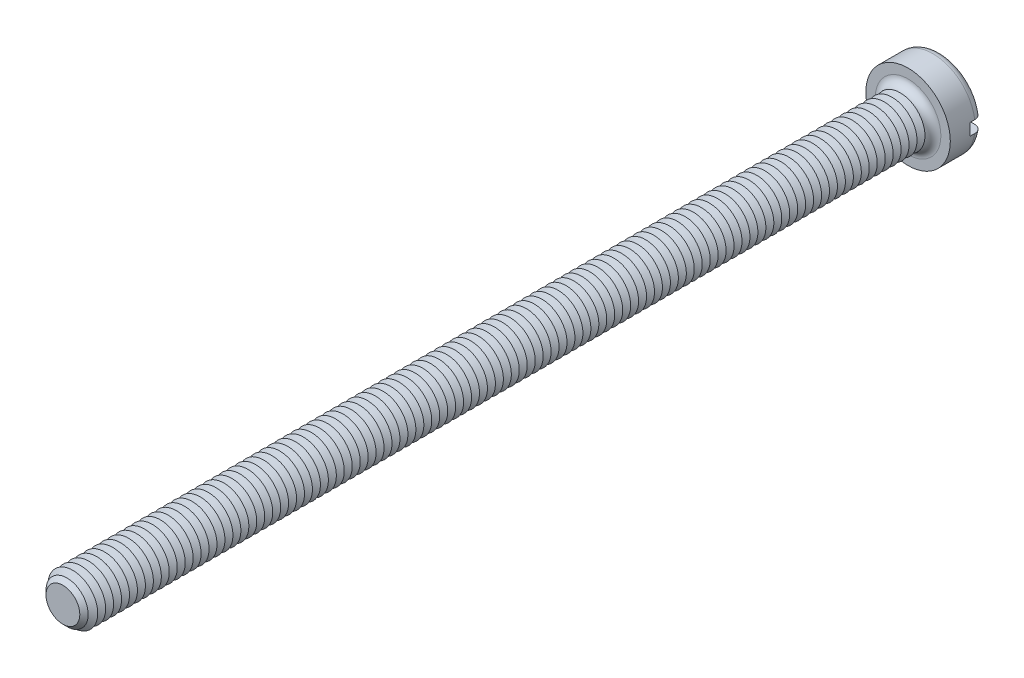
from build123d import *

# Parameters (mm, degrees)
SKETCH3_R           = 4.25
BOSS_EXTRUDE2_DEPTH = 3.3
SKETCH4_R           = 2.5
BOSS_EXTRUDE3_DEPTH = 85
FILLET1_R           = 0.8
CHAMFER1_SIZE       = 0.8
LPATTERN1_COUNT     = 105
LPATTERN1_PITCH     = 0.8
SKETCH8_W           = 8.5
SKETCH8_H           = 1.2
CUT_EXTRUDE1_DEPTH  = 1.3


with BuildPart() as part:
    # Sketch3 → Boss-Extrude2 (new body)
    with BuildSketch(Plane.XY):
        Circle(SKETCH3_R)
    extrude(amount=-BOSS_EXTRUDE2_DEPTH)

    # Sketch4 → Boss-Extrude3 (add)
    with BuildSketch(Plane.XY):
        Circle(SKETCH4_R)
    extrude(amount=BOSS_EXTRUDE3_DEPTH)

    # Fillet1
    fillet1_edges = [part.edges().sort_by_distance(p)[0] for p in [
        (-4.25, 0, -3.3),
        (-2.5, 0, 0),
    ]]
    fillet(fillet1_edges, radius=FILLET1_R)

    # Chamfer1
    chamfer1_edges = [part.edges().sort_by_distance(p)[0] for p in [
        (-2.5, 0, 85),
    ]]
    chamfer(chamfer1_edges, length=CHAMFER1_SIZE)

    # Sketch6 → Cut-Revolve1 (revolve, cut)
    with BuildSketch(Plane(origin=(0, 0, 0), x_dir=(0, 0, -1), z_dir=(1, 0, 0)), mode=Mode.PRIVATE) as cut_revolve1_sk:
        Polygon((-0.8, 2.5), (-1.2, 1.807179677), (-1.6, 2.5), align=None)
    cut_revolve1 = revolve(cut_revolve1_sk.sketch.rotate(Axis((0, 0, -1.694361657), (0, 0, 1)), 90), axis=Axis((0, 0, -1.694361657), (0, 0, 1)), mode=Mode.SUBTRACT)

    # LPattern1: Cut-Revolve1 ×105
    with Locations(*[(0, 0, i * LPATTERN1_PITCH) for i in range(1, LPATTERN1_COUNT)]):
        add(cut_revolve1, mode=Mode.SUBTRACT)

    # Sketch8 → Cut-Extrude1 (cut)
    with BuildSketch(Plane(origin=(0, 0, -3.3), x_dir=(-1, 0, 0), z_dir=(0, 0, -1))):
        Rectangle(SKETCH8_W, SKETCH8_H)
    extrude(amount=-CUT_EXTRUDE1_DEPTH, mode=Mode.SUBTRACT)


solid = part.part
